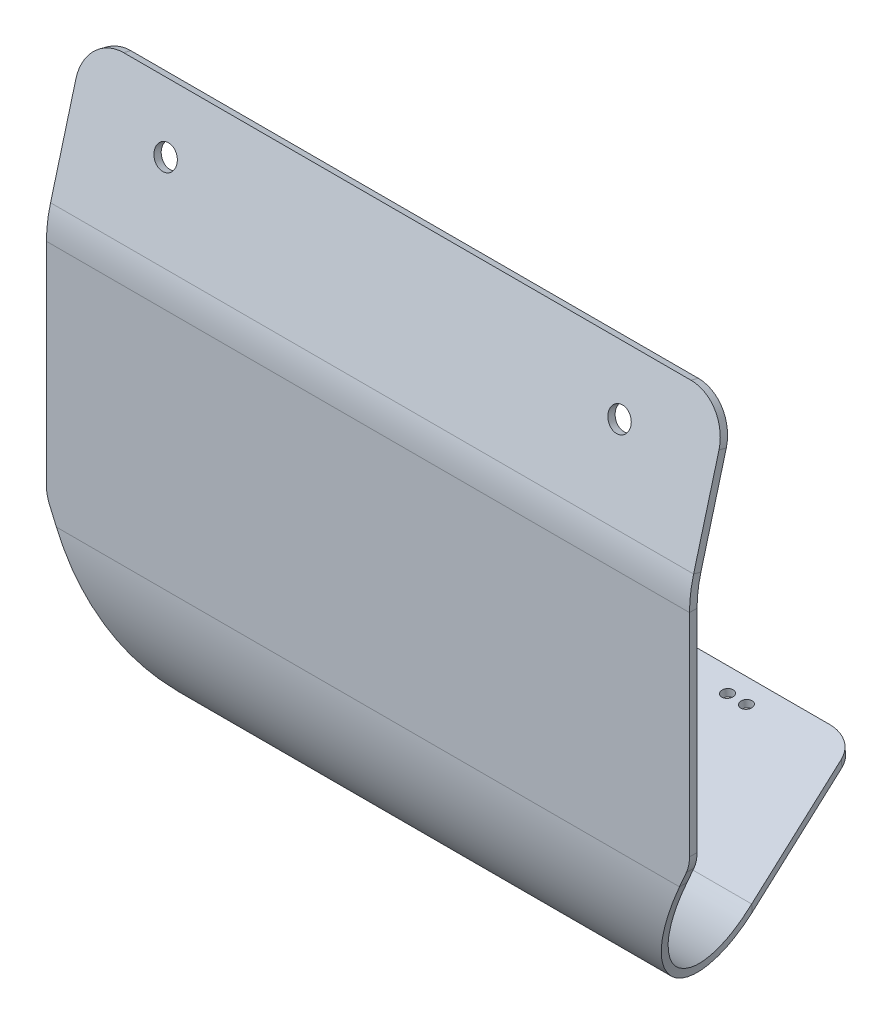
ISO-10303-21;
HEADER;
FILE_DESCRIPTION(('STEP AP214'),'2;1');
FILE_NAME('part.step','',(''),(''),'','','');
FILE_SCHEMA(('AUTOMOTIVE_DESIGN { 1 0 10303 214 1 1 1 1 }'));
ENDSEC;
DATA;
#1=APPLICATION_CONTEXT('core data for automotive mechanical design processes');
#2=APPLICATION_PROTOCOL_DEFINITION('international standard','automotive_design',2000,#1);
#3=PRODUCT_CONTEXT('',#1,'mechanical');
#4=PRODUCT('Part','Part','',(#3));
#5=PRODUCT_RELATED_PRODUCT_CATEGORY('part','',(#4));
#6=PRODUCT_DEFINITION_FORMATION('','',#4);
#7=PRODUCT_DEFINITION_CONTEXT('part definition',#1,'design');
#8=PRODUCT_DEFINITION('design','',#6,#7);
#9=PRODUCT_DEFINITION_SHAPE('','',#8);
#10=(LENGTH_UNIT() NAMED_UNIT(*) SI_UNIT(.MILLI.,.METRE.));
#11=(NAMED_UNIT(*) PLANE_ANGLE_UNIT() SI_UNIT($,.RADIAN.));
#12=(NAMED_UNIT(*) SI_UNIT($,.STERADIAN.) SOLID_ANGLE_UNIT());
#13=UNCERTAINTY_MEASURE_WITH_UNIT(LENGTH_MEASURE(1.E-05),#10,'distance_accuracy_value','');
#14=(GEOMETRIC_REPRESENTATION_CONTEXT(3) GLOBAL_UNCERTAINTY_ASSIGNED_CONTEXT((#13)) GLOBAL_UNIT_ASSIGNED_CONTEXT((#10,
#11,#12)) REPRESENTATION_CONTEXT('',''));
#15=CARTESIAN_POINT('',(0.,0.,0.));
#16=DIRECTION('',(0.,0.,1.));
#17=DIRECTION('',(1.,0.,0.));
#18=AXIS2_PLACEMENT_3D('',#15,#16,#17);
#19=CARTESIAN_POINT('',(-75.,56.6685683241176,-8.39287601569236));
#20=DIRECTION('',(0.,-0.965925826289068,0.258819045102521));
#21=DIRECTION('',(0.,-0.258819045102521,-0.965925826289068));
#22=AXIS2_PLACEMENT_3D('',#19,#20,#21);
#23=PLANE('',#22);
#24=DIRECTION('',(-1.,0.,0.));
#25=VECTOR('',#24,1.);
#26=CARTESIAN_POINT('',(-75.,56.1509302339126,-10.3247276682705));
#27=LINE('',#26,#25);
#28=CARTESIAN_POINT('',(75.,56.1509302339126,-10.3247276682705));
#29=VERTEX_POINT('',#28);
#30=CARTESIAN_POINT('',(-75.,56.1509302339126,-10.3247276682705));
#31=VERTEX_POINT('',#30);
#32=EDGE_CURVE('E49',#29,#31,#27,.T.);
#33=ORIENTED_EDGE('',*,*,#32,.T.);
#34=DIRECTION('',(0.,-0.258819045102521,-0.965925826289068));
#35=VECTOR('',#34,1.);
#36=CARTESIAN_POINT('',(-75.,56.6685683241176,-8.39287601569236));
#37=LINE('',#36,#35);
#38=CARTESIAN_POINT('',(-75.,56.6685683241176,-8.39287601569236));
#39=VERTEX_POINT('',#38);
#40=EDGE_CURVE('E262',#39,#31,#37,.T.);
#41=ORIENTED_EDGE('',*,*,#40,.F.);
#42=DIRECTION('',(-1.,0.,0.));
#43=VECTOR('',#42,1.);
#44=CARTESIAN_POINT('',(-75.,56.6685683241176,-8.39287601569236));
#45=LINE('',#44,#43);
#46=CARTESIAN_POINT('',(75.,56.6685683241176,-8.39287601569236));
#47=VERTEX_POINT('',#46);
#48=EDGE_CURVE('E243',#47,#39,#45,.T.);
#49=ORIENTED_EDGE('',*,*,#48,.F.);
#50=DIRECTION('',(0.,-0.258819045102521,-0.965925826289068));
#51=VECTOR('',#50,1.);
#52=CARTESIAN_POINT('',(75.,56.6685683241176,-8.39287601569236));
#53=LINE('',#52,#51);
#54=EDGE_CURVE('E278',#47,#29,#53,.T.);
#55=ORIENTED_EDGE('',*,*,#54,.T.);
#56=EDGE_LOOP('',(#33,#41,#49,#55));
#57=FACE_BOUND('',#56,.T.);
#58=ADVANCED_FACE('F30',(#57),#23,.F.);
#59=CARTESIAN_POINT('',(75.,47.009310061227,-5.80468556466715));
#60=DIRECTION('',(0.,-0.258819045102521,-0.965925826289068));
#61=DIRECTION('',(-1.,0.,0.));
#62=AXIS2_PLACEMENT_3D('',#59,#60,#61);
#63=CYLINDRICAL_SURFACE('',#62,9.99999999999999);
#64=CARTESIAN_POINT('',(75.,46.4916719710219,-7.73653721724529));
#65=DIRECTION('',(0.,0.258819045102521,0.965925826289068));
#66=DIRECTION('',(1.,0.,0.));
#67=AXIS2_PLACEMENT_3D('',#64,#65,#66);
#68=CIRCLE('',#67,9.99999999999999);
#69=CARTESIAN_POINT('',(85.,46.4916719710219,-7.73653721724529));
#70=VERTEX_POINT('',#69);
#71=EDGE_CURVE('E275',#70,#29,#68,.T.);
#72=ORIENTED_EDGE('',*,*,#71,.T.);
#73=ORIENTED_EDGE('',*,*,#54,.F.);
#74=CARTESIAN_POINT('',(75.,47.009310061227,-5.80468556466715));
#75=DIRECTION('',(0.,0.258819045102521,0.965925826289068));
#76=DIRECTION('',(1.,0.,0.));
#77=AXIS2_PLACEMENT_3D('',#74,#75,#76);
#78=CIRCLE('',#77,9.99999999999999);
#79=CARTESIAN_POINT('',(85.,47.009310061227,-5.80468556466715));
#80=VERTEX_POINT('',#79);
#81=EDGE_CURVE('E245',#80,#47,#78,.T.);
#82=ORIENTED_EDGE('',*,*,#81,.F.);
#83=DIRECTION('',(0.,-0.258819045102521,-0.965925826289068));
#84=VECTOR('',#83,1.);
#85=CARTESIAN_POINT('',(85.,47.009310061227,-5.80468556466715));
#86=LINE('',#85,#84);
#87=EDGE_CURVE('E272',#80,#70,#86,.T.);
#88=ORIENTED_EDGE('',*,*,#87,.T.);
#89=EDGE_LOOP('',(#72,#73,#82,#88));
#90=FACE_BOUND('',#89,.T.);
#91=ADVANCED_FACE('F479',(#90),#63,.T.);
#92=CARTESIAN_POINT('',(-60.,42.1796809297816,-4.51059033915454));
#93=DIRECTION('',(0.,-0.258819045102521,-0.965925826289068));
#94=DIRECTION('',(-1.,0.,0.));
#95=AXIS2_PLACEMENT_3D('',#92,#93,#94);
#96=CYLINDRICAL_SURFACE('',#95,3.);
#97=CARTESIAN_POINT('',(-60.,42.1796809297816,-4.51059033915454));
#98=DIRECTION('',(0.,0.258819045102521,0.965925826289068));
#99=DIRECTION('',(1.,0.,0.));
#100=AXIS2_PLACEMENT_3D('',#97,#98,#99);
#101=CIRCLE('',#100,3.);
#102=CARTESIAN_POINT('',(-57.,42.1796809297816,-4.51059033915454));
#103=VERTEX_POINT('',#102);
#104=EDGE_CURVE('E269',#103,#103,#101,.T.);
#105=ORIENTED_EDGE('',*,*,#104,.T.);
#106=EDGE_LOOP('',(#105));
#107=FACE_BOUND('',#106,.T.);
#108=CARTESIAN_POINT('',(-60.,41.6620428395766,-6.44244199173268));
#109=DIRECTION('',(0.,0.258819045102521,0.965925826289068));
#110=DIRECTION('',(1.,0.,0.));
#111=AXIS2_PLACEMENT_3D('',#108,#109,#110);
#112=CIRCLE('',#111,3.);
#113=CARTESIAN_POINT('',(-57.,41.6620428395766,-6.44244199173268));
#114=VERTEX_POINT('',#113);
#115=EDGE_CURVE('E40',#114,#114,#112,.T.);
#116=ORIENTED_EDGE('',*,*,#115,.F.);
#117=EDGE_LOOP('',(#116));
#118=FACE_BOUND('',#117,.T.);
#119=ADVANCED_FACE('F484',(#107,#118),#96,.F.);
#120=CARTESIAN_POINT('',(60.,42.1796809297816,-4.51059033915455));
#121=DIRECTION('',(0.,-0.258819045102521,-0.965925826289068));
#122=DIRECTION('',(-1.,0.,0.));
#123=AXIS2_PLACEMENT_3D('',#120,#121,#122);
#124=CYLINDRICAL_SURFACE('',#123,3.00000000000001);
#125=CARTESIAN_POINT('',(60.,42.1796809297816,-4.51059033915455));
#126=DIRECTION('',(0.,0.258819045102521,0.965925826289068));
#127=DIRECTION('',(1.,0.,0.));
#128=AXIS2_PLACEMENT_3D('',#125,#126,#127);
#129=CIRCLE('',#128,3.00000000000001);
#130=CARTESIAN_POINT('',(63.,42.1796809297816,-4.51059033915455));
#131=VERTEX_POINT('',#130);
#132=EDGE_CURVE('E266',#131,#131,#129,.T.);
#133=ORIENTED_EDGE('',*,*,#132,.T.);
#134=EDGE_LOOP('',(#133));
#135=FACE_BOUND('',#134,.T.);
#136=CARTESIAN_POINT('',(60.,41.6620428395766,-6.44244199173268));
#137=DIRECTION('',(0.,0.258819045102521,0.965925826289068));
#138=DIRECTION('',(1.,0.,0.));
#139=AXIS2_PLACEMENT_3D('',#136,#137,#138);
#140=CIRCLE('',#139,3.00000000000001);
#141=CARTESIAN_POINT('',(63.,41.6620428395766,-6.44244199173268));
#142=VERTEX_POINT('',#141);
#143=EDGE_CURVE('E11',#142,#142,#140,.T.);
#144=ORIENTED_EDGE('',*,*,#143,.F.);
#145=EDGE_LOOP('',(#144));
#146=FACE_BOUND('',#145,.T.);
#147=ADVANCED_FACE('F492',(#135,#146),#124,.F.);
#148=CARTESIAN_POINT('',(-75.,47.009310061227,-5.80468556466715));
#149=DIRECTION('',(0.,-0.258819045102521,-0.965925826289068));
#150=DIRECTION('',(-1.,0.,0.));
#151=AXIS2_PLACEMENT_3D('',#148,#149,#150);
#152=CYLINDRICAL_SURFACE('',#151,10.);
#153=CARTESIAN_POINT('',(-75.,46.4916719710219,-7.73653721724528));
#154=DIRECTION('',(0.,0.258819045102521,0.965925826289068));
#155=DIRECTION('',(-1.,0.,0.));
#156=AXIS2_PLACEMENT_3D('',#153,#154,#155);
#157=CIRCLE('',#156,10.);
#158=CARTESIAN_POINT('',(-85.,46.4916719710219,-7.73653721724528));
#159=VERTEX_POINT('',#158);
#160=EDGE_CURVE('E264',#31,#159,#157,.T.);
#161=ORIENTED_EDGE('',*,*,#160,.T.);
#162=DIRECTION('',(0.,-0.258819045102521,-0.965925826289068));
#163=VECTOR('',#162,1.);
#164=CARTESIAN_POINT('',(-85.,47.009310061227,-5.80468556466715));
#165=LINE('',#164,#163);
#166=CARTESIAN_POINT('',(-85.,47.009310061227,-5.80468556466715));
#167=VERTEX_POINT('',#166);
#168=EDGE_CURVE('E259',#167,#159,#165,.T.);
#169=ORIENTED_EDGE('',*,*,#168,.F.);
#170=CARTESIAN_POINT('',(-75.,47.009310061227,-5.80468556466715));
#171=DIRECTION('',(0.,0.258819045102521,0.965925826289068));
#172=DIRECTION('',(-1.,0.,0.));
#173=AXIS2_PLACEMENT_3D('',#170,#171,#172);
#174=CIRCLE('',#173,10.);
#175=EDGE_CURVE('E241',#39,#167,#174,.T.);
#176=ORIENTED_EDGE('',*,*,#175,.F.);
#177=ORIENTED_EDGE('',*,*,#40,.T.);
#178=EDGE_LOOP('',(#161,#169,#176,#177));
#179=FACE_BOUND('',#178,.T.);
#180=ADVANCED_FACE('F496',(#179),#152,.T.);
#181=CARTESIAN_POINT('',(-85.,-39.9240143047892,17.4890284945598));
#182=DIRECTION('',(1.,0.,0.));
#183=DIRECTION('',(0.,-0.258819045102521,-0.965925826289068));
#184=AXIS2_PLACEMENT_3D('',#181,#182,#183);
#185=PLANE('',#184);
#186=DIRECTION('',(0.,-0.258819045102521,-0.965925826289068));
#187=VECTOR('',#186,1.);
#188=CARTESIAN_POINT('',(-85.,21.9511565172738,0.909626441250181));
#189=LINE('',#188,#187);
#190=CARTESIAN_POINT('',(-85.,21.9511565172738,0.909626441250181));
#191=VERTEX_POINT('',#190);
#192=CARTESIAN_POINT('',(-85.,21.4335184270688,-1.02222521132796));
#193=VERTEX_POINT('',#192);
#194=EDGE_CURVE('E34',#191,#193,#189,.T.);
#195=ORIENTED_EDGE('',*,*,#194,.F.);
#196=DIRECTION('',(0.,-0.965925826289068,0.258819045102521));
#197=VECTOR('',#196,1.);
#198=CARTESIAN_POINT('',(-85.,-39.9240143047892,17.4890284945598));
#199=LINE('',#198,#197);
#200=EDGE_CURVE('E253',#167,#191,#199,.T.);
#201=ORIENTED_EDGE('',*,*,#200,.F.);
#202=ORIENTED_EDGE('',*,*,#168,.T.);
#203=DIRECTION('',(0.,-0.965925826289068,0.258819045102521));
#204=VECTOR('',#203,1.);
#205=CARTESIAN_POINT('',(-85.,-40.4416523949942,15.5571768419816));
#206=LINE('',#205,#204);
#207=EDGE_CURVE('E256',#159,#193,#206,.T.);
#208=ORIENTED_EDGE('',*,*,#207,.T.);
#209=EDGE_LOOP('',(#195,#201,#202,#208));
#210=FACE_BOUND('',#209,.T.);
#211=ADVANCED_FACE('F500',(#210),#185,.F.);
#212=CARTESIAN_POINT('',(75.,47.009310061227,-5.80468556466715));
#213=DIRECTION('',(0.,0.258819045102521,0.965925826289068));
#214=DIRECTION('',(1.,0.,0.));
#215=AXIS2_PLACEMENT_3D('',#212,#213,#214);
#216=PLANE('',#215);
#217=ORIENTED_EDGE('',*,*,#132,.F.);
#218=EDGE_LOOP('',(#217));
#219=FACE_BOUND('',#218,.T.);
#220=ORIENTED_EDGE('',*,*,#104,.F.);
#221=EDGE_LOOP('',(#220));
#222=FACE_BOUND('',#221,.T.);
#223=ORIENTED_EDGE('',*,*,#200,.T.);
#224=DIRECTION('',(1.,0.,0.));
#225=VECTOR('',#224,1.);
#226=CARTESIAN_POINT('',(75.,21.9511565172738,0.90962644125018));
#227=LINE('',#226,#225);
#228=CARTESIAN_POINT('',(85.,21.9511565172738,0.90962644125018));
#229=VERTEX_POINT('',#228);
#230=EDGE_CURVE('E250',#191,#229,#227,.T.);
#231=ORIENTED_EDGE('',*,*,#230,.T.);
#232=DIRECTION('',(0.,0.965925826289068,-0.258819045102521));
#233=VECTOR('',#232,1.);
#234=CARTESIAN_POINT('',(85.,47.009310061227,-5.80468556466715));
#235=LINE('',#234,#233);
#236=EDGE_CURVE('E248',#229,#80,#235,.T.);
#237=ORIENTED_EDGE('',*,*,#236,.T.);
#238=ORIENTED_EDGE('',*,*,#81,.T.);
#239=ORIENTED_EDGE('',*,*,#48,.T.);
#240=ORIENTED_EDGE('',*,*,#175,.T.);
#241=EDGE_LOOP('',(#223,#231,#237,#238,#239,#240));
#242=FACE_BOUND('',#241,.T.);
#243=ADVANCED_FACE('F504',(#219,#222,#242),#216,.T.);
#244=CARTESIAN_POINT('',(85.,47.009310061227,-5.80468556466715));
#245=DIRECTION('',(-1.,0.,0.));
#246=DIRECTION('',(0.,-0.965925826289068,0.258819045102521));
#247=AXIS2_PLACEMENT_3D('',#244,#245,#246);
#248=PLANE('',#247);
#249=DIRECTION('',(0.,0.258819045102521,0.965925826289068));
#250=VECTOR('',#249,1.);
#251=CARTESIAN_POINT('',(85.,21.9511565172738,0.90962644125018));
#252=LINE('',#251,#250);
#253=CARTESIAN_POINT('',(85.,21.4335184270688,-1.02222521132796));
#254=VERTEX_POINT('',#253);
#255=EDGE_CURVE('E281',#254,#229,#252,.T.);
#256=ORIENTED_EDGE('',*,*,#255,.F.);
#257=DIRECTION('',(0.,0.965925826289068,-0.258819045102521));
#258=VECTOR('',#257,1.);
#259=CARTESIAN_POINT('',(85.,46.4916719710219,-7.73653721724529));
#260=LINE('',#259,#258);
#261=EDGE_CURVE('E239',#254,#70,#260,.T.);
#262=ORIENTED_EDGE('',*,*,#261,.T.);
#263=ORIENTED_EDGE('',*,*,#87,.F.);
#264=ORIENTED_EDGE('',*,*,#236,.F.);
#265=EDGE_LOOP('',(#256,#262,#263,#264));
#266=FACE_BOUND('',#265,.T.);
#267=ADVANCED_FACE('F507',(#266),#248,.F.);
#268=CARTESIAN_POINT('',(75.,46.4916719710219,-7.73653721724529));
#269=DIRECTION('',(0.,0.258819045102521,0.965925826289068));
#270=DIRECTION('',(1.,0.,0.));
#271=AXIS2_PLACEMENT_3D('',#268,#269,#270);
#272=PLANE('',#271);
#273=DIRECTION('',(1.,0.,0.));
#274=VECTOR('',#273,1.);
#275=CARTESIAN_POINT('',(75.,21.4335184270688,-1.02222521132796));
#276=LINE('',#275,#274);
#277=EDGE_CURVE('E282',#193,#254,#276,.T.);
#278=ORIENTED_EDGE('',*,*,#277,.F.);
#279=ORIENTED_EDGE('',*,*,#207,.F.);
#280=ORIENTED_EDGE('',*,*,#160,.F.);
#281=ORIENTED_EDGE('',*,*,#32,.F.);
#282=ORIENTED_EDGE('',*,*,#71,.F.);
#283=ORIENTED_EDGE('',*,*,#261,.F.);
#284=EDGE_LOOP('',(#278,#279,#280,#281,#282,#283));
#285=FACE_BOUND('',#284,.T.);
#286=ORIENTED_EDGE('',*,*,#115,.T.);
#287=EDGE_LOOP('',(#286));
#288=FACE_BOUND('',#287,.T.);
#289=ORIENTED_EDGE('',*,*,#143,.T.);
#290=EDGE_LOOP('',(#289));
#291=FACE_BOUND('',#290,.T.);
#292=ADVANCED_FACE('F32',(#285,#288,#291),#272,.F.);
#293=CARTESIAN_POINT('',(18.4450686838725,-98.9511681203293,-101.674468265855));
#294=DIRECTION('',(0.,-0.0697564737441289,0.997564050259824));
#295=DIRECTION('',(-1.,0.,0.));
#296=AXIS2_PLACEMENT_3D('',#293,#294,#295);
#297=PLANE('',#296);
#298=DIRECTION('',(1.,0.,0.));
#299=VECTOR('',#298,1.);
#300=CARTESIAN_POINT('',(18.4450686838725,-96.9560400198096,-101.534955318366));
#301=LINE('',#300,#299);
#302=CARTESIAN_POINT('',(-18.4450686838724,-96.9560400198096,-101.534955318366));
#303=VERTEX_POINT('',#302);
#304=CARTESIAN_POINT('',(18.4450686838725,-96.9560400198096,-101.534955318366));
#305=VERTEX_POINT('',#304);
#306=EDGE_CURVE('E118',#303,#305,#301,.T.);
#307=ORIENTED_EDGE('',*,*,#306,.T.);
#308=DIRECTION('',(0.,0.997564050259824,0.0697564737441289));
#309=VECTOR('',#308,1.);
#310=CARTESIAN_POINT('',(18.4450686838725,-98.9511681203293,-101.674468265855));
#311=LINE('',#310,#309);
#312=CARTESIAN_POINT('',(18.4450686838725,-98.9511681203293,-101.674468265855));
#313=VERTEX_POINT('',#312);
#314=EDGE_CURVE('E308',#313,#305,#311,.T.);
#315=ORIENTED_EDGE('',*,*,#314,.F.);
#316=DIRECTION('',(1.,0.,0.));
#317=VECTOR('',#316,1.);
#318=CARTESIAN_POINT('',(18.4450686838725,-98.9511681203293,-101.674468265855));
#319=LINE('',#318,#317);
#320=CARTESIAN_POINT('',(-18.4450686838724,-98.9511681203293,-101.674468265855));
#321=VERTEX_POINT('',#320);
#322=EDGE_CURVE('E299',#321,#313,#319,.T.);
#323=ORIENTED_EDGE('',*,*,#322,.F.);
#324=DIRECTION('',(0.,0.997564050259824,0.0697564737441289));
#325=VECTOR('',#324,1.);
#326=CARTESIAN_POINT('',(-18.4450686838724,-98.9511681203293,-101.674468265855));
#327=LINE('',#326,#325);
#328=EDGE_CURVE('E322',#321,#303,#327,.T.);
#329=ORIENTED_EDGE('',*,*,#328,.T.);
#330=EDGE_LOOP('',(#307,#315,#323,#329));
#331=FACE_BOUND('',#330,.T.);
#332=ADVANCED_FACE('F460',(#331),#297,.F.);
#333=CARTESIAN_POINT('',(-18.4450686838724,-99.6487328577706,-91.6988277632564));
#334=DIRECTION('',(0.,0.997564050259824,0.0697564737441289));
#335=DIRECTION('',(-1.,0.,0.));
#336=AXIS2_PLACEMENT_3D('',#333,#334,#335);
#337=CYLINDRICAL_SURFACE('',#336,10.);
#338=CARTESIAN_POINT('',(-18.4450686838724,-97.6536047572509,-91.5593148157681));
#339=DIRECTION('',(0.,-0.997564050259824,-0.0697564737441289));
#340=DIRECTION('',(-1.,0.,0.));
#341=AXIS2_PLACEMENT_3D('',#338,#339,#340);
#342=CIRCLE('',#341,10.);
#343=CARTESIAN_POINT('',(-27.6149129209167,-97.3753301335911,-95.5388273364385));
#344=VERTEX_POINT('',#343);
#345=EDGE_CURVE('E320',#344,#303,#342,.T.);
#346=ORIENTED_EDGE('',*,*,#345,.T.);
#347=ORIENTED_EDGE('',*,*,#328,.F.);
#348=CARTESIAN_POINT('',(-18.4450686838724,-99.6487328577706,-91.6988277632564));
#349=DIRECTION('',(0.,-0.997564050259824,-0.0697564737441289));
#350=DIRECTION('',(-1.,0.,0.));
#351=AXIS2_PLACEMENT_3D('',#348,#349,#350);
#352=CIRCLE('',#351,10.);
#353=CARTESIAN_POINT('',(-27.6149129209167,-99.3704582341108,-95.6783402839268));
#354=VERTEX_POINT('',#353);
#355=EDGE_CURVE('E301',#354,#321,#352,.T.);
#356=ORIENTED_EDGE('',*,*,#355,.F.);
#357=DIRECTION('',(0.,0.997564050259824,0.0697564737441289));
#358=VECTOR('',#357,1.);
#359=CARTESIAN_POINT('',(-27.6149129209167,-99.3704582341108,-95.6783402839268));
#360=LINE('',#359,#358);
#361=EDGE_CURVE('E318',#354,#344,#360,.T.);
#362=ORIENTED_EDGE('',*,*,#361,.T.);
#363=EDGE_LOOP('',(#346,#347,#356,#362));
#364=FACE_BOUND('',#363,.T.);
#365=ADVANCED_FACE('F463',(#364),#337,.T.);
#366=CARTESIAN_POINT('',(2.50000000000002,-99.3697069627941,-95.6890839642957));
#367=DIRECTION('',(0.,0.997564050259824,0.0697564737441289));
#368=DIRECTION('',(-1.,0.,0.));
#369=AXIS2_PLACEMENT_3D('',#366,#367,#368);
#370=CYLINDRICAL_SURFACE('',#369,1.5);
#371=CARTESIAN_POINT('',(2.50000000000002,-99.3697069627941,-95.6890839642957));
#372=DIRECTION('',(0.,-0.997564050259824,-0.0697564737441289));
#373=DIRECTION('',(1.,0.,0.));
#374=AXIS2_PLACEMENT_3D('',#371,#372,#373);
#375=CIRCLE('',#374,1.5);
#376=CARTESIAN_POINT('',(4.00000000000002,-99.3697069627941,-95.6890839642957));
#377=VERTEX_POINT('',#376);
#378=EDGE_CURVE('E315',#377,#377,#375,.T.);
#379=ORIENTED_EDGE('',*,*,#378,.T.);
#380=EDGE_LOOP('',(#379));
#381=FACE_BOUND('',#380,.T.);
#382=CARTESIAN_POINT('',(2.50000000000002,-97.3745788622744,-95.5495710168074));
#383=DIRECTION('',(0.,-0.997564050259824,-0.0697564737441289));
#384=DIRECTION('',(1.,0.,0.));
#385=AXIS2_PLACEMENT_3D('',#382,#383,#384);
#386=CIRCLE('',#385,1.5);
#387=CARTESIAN_POINT('',(4.00000000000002,-97.3745788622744,-95.5495710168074));
#388=VERTEX_POINT('',#387);
#389=EDGE_CURVE('E285',#388,#388,#386,.T.);
#390=ORIENTED_EDGE('',*,*,#389,.F.);
#391=EDGE_LOOP('',(#390));
#392=FACE_BOUND('',#391,.T.);
#393=ADVANCED_FACE('F466',(#381,#392),#370,.F.);
#394=CARTESIAN_POINT('',(-2.49999999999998,-99.3697069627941,-95.6890839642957));
#395=DIRECTION('',(0.,0.997564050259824,0.0697564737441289));
#396=DIRECTION('',(-1.,0.,0.));
#397=AXIS2_PLACEMENT_3D('',#394,#395,#396);
#398=CYLINDRICAL_SURFACE('',#397,1.5);
#399=CARTESIAN_POINT('',(-2.49999999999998,-99.3697069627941,-95.6890839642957));
#400=DIRECTION('',(0.,-0.997564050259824,-0.0697564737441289));
#401=DIRECTION('',(1.,0.,0.));
#402=AXIS2_PLACEMENT_3D('',#399,#400,#401);
#403=CIRCLE('',#402,1.5);
#404=CARTESIAN_POINT('',(-0.999999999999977,-99.3697069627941,-95.6890839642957));
#405=VERTEX_POINT('',#404);
#406=EDGE_CURVE('E312',#405,#405,#403,.T.);
#407=ORIENTED_EDGE('',*,*,#406,.T.);
#408=EDGE_LOOP('',(#407));
#409=FACE_BOUND('',#408,.T.);
#410=CARTESIAN_POINT('',(-2.49999999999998,-97.3745788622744,-95.5495710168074));
#411=DIRECTION('',(0.,-0.997564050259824,-0.0697564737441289));
#412=DIRECTION('',(1.,0.,0.));
#413=AXIS2_PLACEMENT_3D('',#410,#411,#412);
#414=CIRCLE('',#413,1.5);
#415=CARTESIAN_POINT('',(-0.999999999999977,-97.3745788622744,-95.5495710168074));
#416=VERTEX_POINT('',#415);
#417=EDGE_CURVE('E283',#416,#416,#414,.T.);
#418=ORIENTED_EDGE('',*,*,#417,.F.);
#419=EDGE_LOOP('',(#418));
#420=FACE_BOUND('',#419,.T.);
#421=ADVANCED_FACE('F469',(#409,#420),#398,.F.);
#422=CARTESIAN_POINT('',(18.4450686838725,-99.6487328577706,-91.6988277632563));
#423=DIRECTION('',(0.,0.997564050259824,0.0697564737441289));
#424=DIRECTION('',(-1.,0.,0.));
#425=AXIS2_PLACEMENT_3D('',#422,#423,#424);
#426=CYLINDRICAL_SURFACE('',#425,10.);
#427=CARTESIAN_POINT('',(18.4450686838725,-97.6536047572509,-91.5593148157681));
#428=DIRECTION('',(0.,-0.997564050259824,-0.0697564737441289));
#429=DIRECTION('',(-1.,0.,0.));
#430=AXIS2_PLACEMENT_3D('',#427,#428,#429);
#431=CIRCLE('',#430,10.);
#432=CARTESIAN_POINT('',(27.6149129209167,-97.3753301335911,-95.5388273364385));
#433=VERTEX_POINT('',#432);
#434=EDGE_CURVE('E310',#305,#433,#431,.T.);
#435=ORIENTED_EDGE('',*,*,#434,.T.);
#436=DIRECTION('',(0.,0.997564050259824,0.0697564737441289));
#437=VECTOR('',#436,1.);
#438=CARTESIAN_POINT('',(27.6149129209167,-99.3704582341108,-95.6783402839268));
#439=LINE('',#438,#437);
#440=CARTESIAN_POINT('',(27.6149129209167,-99.3704582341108,-95.6783402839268));
#441=VERTEX_POINT('',#440);
#442=EDGE_CURVE('E304',#441,#433,#439,.T.);
#443=ORIENTED_EDGE('',*,*,#442,.F.);
#444=CARTESIAN_POINT('',(18.4450686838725,-99.6487328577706,-91.6988277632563));
#445=DIRECTION('',(0.,-0.997564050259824,-0.0697564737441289));
#446=DIRECTION('',(-1.,0.,0.));
#447=AXIS2_PLACEMENT_3D('',#444,#445,#446);
#448=CIRCLE('',#447,10.);
#449=EDGE_CURVE('E297',#313,#441,#448,.T.);
#450=ORIENTED_EDGE('',*,*,#449,.F.);
#451=ORIENTED_EDGE('',*,*,#314,.T.);
#452=EDGE_LOOP('',(#435,#443,#450,#451));
#453=FACE_BOUND('',#452,.T.);
#454=ADVANCED_FACE('F362',(#453),#426,.T.);
#455=CARTESIAN_POINT('',(84.1698442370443,-108.438799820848,34.0049862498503));
#456=DIRECTION('',(-0.916984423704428,-0.0278274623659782,0.397951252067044));
#457=DIRECTION('',(-0.398923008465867,0.0639655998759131,-0.91475069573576));
#458=AXIS2_PLACEMENT_3D('',#455,#456,#457);
#459=PLANE('',#458);
#460=CARTESIAN_POINT('',(45.9533661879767,-102.310950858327,-53.6273366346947));
#461=CARTESIAN_POINT('',(45.9533661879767,-100.315822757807,-53.4878236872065));
#462=B_SPLINE_CURVE_WITH_KNOTS('',1,(#460,#461),.UNSPECIFIED.,.F.,.F.,(2,2),(0.,1.),.UNSPECIFIED.);
#463=CARTESIAN_POINT('',(45.9533661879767,-102.310950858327,-53.6273366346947));
#464=VERTEX_POINT('',#463);
#465=CARTESIAN_POINT('',(45.9533661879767,-100.315822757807,-53.4878236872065));
#466=VERTEX_POINT('',#465);
#467=EDGE_CURVE('E344',#464,#466,#462,.T.);
#468=ORIENTED_EDGE('',*,*,#467,.F.);
#469=DIRECTION('',(0.398923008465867,-0.0639655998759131,0.91475069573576));
#470=VECTOR('',#469,1.);
#471=CARTESIAN_POINT('',(84.1698442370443,-108.438799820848,34.0049862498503));
#472=LINE('',#471,#470);
#473=EDGE_CURVE('E329',#441,#464,#472,.T.);
#474=ORIENTED_EDGE('',*,*,#473,.F.);
#475=ORIENTED_EDGE('',*,*,#442,.T.);
#476=DIRECTION('',(0.398923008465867,-0.0639655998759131,0.91475069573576));
#477=VECTOR('',#476,1.);
#478=CARTESIAN_POINT('',(84.1698442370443,-106.443671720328,34.1444991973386));
#479=LINE('',#478,#477);
#480=EDGE_CURVE('E307',#433,#466,#479,.T.);
#481=ORIENTED_EDGE('',*,*,#480,.T.);
#482=EDGE_LOOP('',(#468,#474,#475,#481));
#483=FACE_BOUND('',#482,.T.);
#484=ADVANCED_FACE('F351',(#483),#459,.F.);
#485=CARTESIAN_POINT('',(75.,-114.995157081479,127.765263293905));
#486=DIRECTION('',(0.,-0.997564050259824,-0.0697564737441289));
#487=DIRECTION('',(1.,0.,0.));
#488=AXIS2_PLACEMENT_3D('',#485,#486,#487);
#489=PLANE('',#488);
#490=ORIENTED_EDGE('',*,*,#406,.F.);
#491=EDGE_LOOP('',(#490));
#492=FACE_BOUND('',#491,.T.);
#493=ORIENTED_EDGE('',*,*,#378,.F.);
#494=EDGE_LOOP('',(#493));
#495=FACE_BOUND('',#494,.T.);
#496=ORIENTED_EDGE('',*,*,#473,.T.);
#497=DIRECTION('',(-1.,0.,0.));
#498=VECTOR('',#497,1.);
#499=CARTESIAN_POINT('',(75.,-102.310950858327,-53.6273366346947));
#500=LINE('',#499,#498);
#501=CARTESIAN_POINT('',(-45.9533661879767,-102.310950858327,-53.6273366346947));
#502=VERTEX_POINT('',#501);
#503=EDGE_CURVE('E326',#464,#502,#500,.T.);
#504=ORIENTED_EDGE('',*,*,#503,.T.);
#505=DIRECTION('',(0.398923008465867,0.0639655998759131,-0.91475069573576));
#506=VECTOR('',#505,1.);
#507=CARTESIAN_POINT('',(-27.6149129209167,-99.3704582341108,-95.6783402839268));
#508=LINE('',#507,#506);
#509=EDGE_CURVE('E303',#502,#354,#508,.T.);
#510=ORIENTED_EDGE('',*,*,#509,.T.);
#511=ORIENTED_EDGE('',*,*,#355,.T.);
#512=ORIENTED_EDGE('',*,*,#322,.T.);
#513=ORIENTED_EDGE('',*,*,#449,.T.);
#514=EDGE_LOOP('',(#496,#504,#510,#511,#512,#513));
#515=FACE_BOUND('',#514,.T.);
#516=ADVANCED_FACE('F361',(#492,#495,#515),#489,.T.);
#517=CARTESIAN_POINT('',(-27.6149129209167,-99.3704582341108,-95.6783402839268));
#518=DIRECTION('',(0.916984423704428,-0.0278274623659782,0.397951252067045));
#519=DIRECTION('',(-0.398923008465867,-0.0639655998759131,0.91475069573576));
#520=AXIS2_PLACEMENT_3D('',#517,#518,#519);
#521=PLANE('',#520);
#522=CARTESIAN_POINT('',(-45.9533661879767,-100.315822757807,-53.4878236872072));
#523=CARTESIAN_POINT('',(-45.9533661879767,-102.310950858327,-53.6273366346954));
#524=B_SPLINE_CURVE_WITH_KNOTS('',1,(#522,#523),.UNSPECIFIED.,.F.,.F.,(2,2),(0.,1.),.UNSPECIFIED.);
#525=CARTESIAN_POINT('',(-45.9533661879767,-100.315822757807,-53.4878236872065));
#526=VERTEX_POINT('',#525);
#527=EDGE_CURVE('E325',#526,#502,#524,.T.);
#528=ORIENTED_EDGE('',*,*,#527,.F.);
#529=DIRECTION('',(0.398923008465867,0.0639655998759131,-0.91475069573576));
#530=VECTOR('',#529,1.);
#531=CARTESIAN_POINT('',(-27.6149129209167,-97.3753301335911,-95.5388273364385));
#532=LINE('',#531,#530);
#533=EDGE_CURVE('E90',#526,#344,#532,.T.);
#534=ORIENTED_EDGE('',*,*,#533,.T.);
#535=ORIENTED_EDGE('',*,*,#361,.F.);
#536=ORIENTED_EDGE('',*,*,#509,.F.);
#537=EDGE_LOOP('',(#528,#534,#535,#536));
#538=FACE_BOUND('',#537,.T.);
#539=ADVANCED_FACE('F366',(#538),#521,.F.);
#540=CARTESIAN_POINT('',(75.,-113.000028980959,127.904776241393));
#541=DIRECTION('',(0.,-0.997564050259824,-0.0697564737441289));
#542=DIRECTION('',(1.,0.,0.));
#543=AXIS2_PLACEMENT_3D('',#540,#541,#542);
#544=PLANE('',#543);
#545=DIRECTION('',(-1.,0.,0.));
#546=VECTOR('',#545,1.);
#547=CARTESIAN_POINT('',(75.,-100.315822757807,-53.4878236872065));
#548=LINE('',#547,#546);
#549=EDGE_CURVE('E349',#466,#526,#548,.T.);
#550=ORIENTED_EDGE('',*,*,#549,.F.);
#551=ORIENTED_EDGE('',*,*,#480,.F.);
#552=ORIENTED_EDGE('',*,*,#434,.F.);
#553=ORIENTED_EDGE('',*,*,#306,.F.);
#554=ORIENTED_EDGE('',*,*,#345,.F.);
#555=ORIENTED_EDGE('',*,*,#533,.F.);
#556=EDGE_LOOP('',(#550,#551,#552,#553,#554,#555));
#557=FACE_BOUND('',#556,.T.);
#558=ORIENTED_EDGE('',*,*,#389,.T.);
#559=EDGE_LOOP('',(#558));
#560=FACE_BOUND('',#559,.T.);
#561=ORIENTED_EDGE('',*,*,#417,.T.);
#562=EDGE_LOOP('',(#561));
#563=FACE_BOUND('',#562,.T.);
#564=ADVANCED_FACE('F371',(#557,#560,#563),#544,.F.);
#565=CARTESIAN_POINT('',(75.,47.72683758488,0.));
#566=DIRECTION('',(0.,0.,1.));
#567=DIRECTION('',(1.,0.,0.));
#568=AXIS2_PLACEMENT_3D('',#565,#566,#567);
#569=PLANE('',#568);
#570=DIRECTION('',(0.,-1.,0.));
#571=VECTOR('',#570,1.);
#572=CARTESIAN_POINT('',(-85.,-42.27316241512,0.));
#573=LINE('',#572,#571);
#574=CARTESIAN_POINT('',(-85.,13.6689470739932,0.));
#575=VERTEX_POINT('',#574);
#576=CARTESIAN_POINT('',(-85.,-42.27316241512,0.));
#577=VERTEX_POINT('',#576);
#578=EDGE_CURVE('E221',#575,#577,#573,.T.);
#579=ORIENTED_EDGE('',*,*,#578,.F.);
#580=DIRECTION('',(1.,0.,0.));
#581=VECTOR('',#580,1.);
#582=CARTESIAN_POINT('',(75.,13.6689470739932,0.));
#583=LINE('',#582,#581);
#584=CARTESIAN_POINT('',(85.,13.6689470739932,0.));
#585=VERTEX_POINT('',#584);
#586=EDGE_CURVE('E198',#575,#585,#583,.T.);
#587=ORIENTED_EDGE('',*,*,#586,.T.);
#588=DIRECTION('',(0.,1.,0.));
#589=VECTOR('',#588,1.);
#590=CARTESIAN_POINT('',(85.,47.72683758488,0.));
#591=LINE('',#590,#589);
#592=CARTESIAN_POINT('',(85.,-42.27316241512,0.));
#593=VERTEX_POINT('',#592);
#594=EDGE_CURVE('E379',#593,#585,#591,.T.);
#595=ORIENTED_EDGE('',*,*,#594,.F.);
#596=CARTESIAN_POINT('',(75.,-42.27316241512,0.));
#597=DIRECTION('',(0.,0.,1.));
#598=DIRECTION('',(-1.,0.,0.));
#599=AXIS2_PLACEMENT_3D('',#596,#597,#598);
#600=CIRCLE('',#599,10.);
#601=CARTESIAN_POINT('',(84.1698442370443,-46.2623924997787,0.));
#602=VERTEX_POINT('',#601);
#603=EDGE_CURVE('E385',#602,#593,#600,.T.);
#604=ORIENTED_EDGE('',*,*,#603,.F.);
#605=DIRECTION('',(0.398923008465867,0.916984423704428,0.));
#606=VECTOR('',#605,1.);
#607=CARTESIAN_POINT('',(84.1698442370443,-46.2623924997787,0.));
#608=LINE('',#607,#606);
#609=CARTESIAN_POINT('',(82.3534617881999,-50.4376202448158,0.));
#610=VERTEX_POINT('',#609);
#611=EDGE_CURVE('E426',#610,#602,#608,.T.);
#612=ORIENTED_EDGE('',*,*,#611,.F.);
#613=DIRECTION('',(-1.,0.,0.));
#614=VECTOR('',#613,1.);
#615=CARTESIAN_POINT('',(75.,-50.4376202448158,0.));
#616=LINE('',#615,#614);
#617=CARTESIAN_POINT('',(-82.3534617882,-50.4376202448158,0.));
#618=VERTEX_POINT('',#617);
#619=EDGE_CURVE('E418',#610,#618,#616,.T.);
#620=ORIENTED_EDGE('',*,*,#619,.T.);
#621=DIRECTION('',(0.398923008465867,-0.916984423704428,0.));
#622=VECTOR('',#621,1.);
#623=CARTESIAN_POINT('',(-27.6149129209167,-176.262392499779,0.));
#624=LINE('',#623,#622);
#625=CARTESIAN_POINT('',(-84.1698442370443,-46.2623924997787,0.));
#626=VERTEX_POINT('',#625);
#627=EDGE_CURVE('E231',#626,#618,#624,.T.);
#628=ORIENTED_EDGE('',*,*,#627,.F.);
#629=CARTESIAN_POINT('',(-75.,-42.27316241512,0.));
#630=DIRECTION('',(0.,0.,1.));
#631=DIRECTION('',(-1.,0.,0.));
#632=AXIS2_PLACEMENT_3D('',#629,#630,#631);
#633=CIRCLE('',#632,10.);
#634=EDGE_CURVE('E229',#577,#626,#633,.T.);
#635=ORIENTED_EDGE('',*,*,#634,.F.);
#636=EDGE_LOOP('',(#579,#587,#595,#604,#612,#620,#628,#635));
#637=FACE_BOUND('',#636,.T.);
#638=ADVANCED_FACE('F227',(#637),#569,.F.);
#639=CARTESIAN_POINT('',(-85.,-42.27316241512,2.));
#640=DIRECTION('',(1.,0.,0.));
#641=DIRECTION('',(0.,0.,-1.));
#642=AXIS2_PLACEMENT_3D('',#639,#640,#641);
#643=PLANE('',#642);
#644=DIRECTION('',(0.,-1.,0.));
#645=VECTOR('',#644,1.);
#646=CARTESIAN_POINT('',(-85.,-42.27316241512,2.));
#647=LINE('',#646,#645);
#648=CARTESIAN_POINT('',(-85.,13.6689470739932,2.));
#649=VERTEX_POINT('',#648);
#650=CARTESIAN_POINT('',(-85.,-42.27316241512,2.));
#651=VERTEX_POINT('',#650);
#652=EDGE_CURVE('E223',#649,#651,#647,.T.);
#653=ORIENTED_EDGE('',*,*,#652,.F.);
#654=DIRECTION('',(0.,0.,-1.));
#655=VECTOR('',#654,1.);
#656=CARTESIAN_POINT('',(-85.,13.6689470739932,2.));
#657=LINE('',#656,#655);
#658=EDGE_CURVE('E208',#649,#575,#657,.T.);
#659=ORIENTED_EDGE('',*,*,#658,.T.);
#660=ORIENTED_EDGE('',*,*,#578,.T.);
#661=DIRECTION('',(0.,0.,-1.));
#662=VECTOR('',#661,1.);
#663=CARTESIAN_POINT('',(-85.,-42.27316241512,2.));
#664=LINE('',#663,#662);
#665=EDGE_CURVE('E411',#651,#577,#664,.T.);
#666=ORIENTED_EDGE('',*,*,#665,.F.);
#667=EDGE_LOOP('',(#653,#659,#660,#666));
#668=FACE_BOUND('',#667,.T.);
#669=ADVANCED_FACE('F219',(#668),#643,.F.);
#670=CARTESIAN_POINT('',(85.,47.72683758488,2.));
#671=DIRECTION('',(-1.,0.,0.));
#672=DIRECTION('',(0.,-1.,0.));
#673=AXIS2_PLACEMENT_3D('',#670,#671,#672);
#674=PLANE('',#673);
#675=ORIENTED_EDGE('',*,*,#594,.T.);
#676=DIRECTION('',(0.,0.,1.));
#677=VECTOR('',#676,1.);
#678=CARTESIAN_POINT('',(85.,13.6689470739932,2.));
#679=LINE('',#678,#677);
#680=CARTESIAN_POINT('',(85.,13.6689470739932,2.));
#681=VERTEX_POINT('',#680);
#682=EDGE_CURVE('E224',#585,#681,#679,.T.);
#683=ORIENTED_EDGE('',*,*,#682,.T.);
#684=DIRECTION('',(0.,1.,0.));
#685=VECTOR('',#684,1.);
#686=CARTESIAN_POINT('',(85.,47.72683758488,2.));
#687=LINE('',#686,#685);
#688=CARTESIAN_POINT('',(85.,-42.27316241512,2.));
#689=VERTEX_POINT('',#688);
#690=EDGE_CURVE('E386',#689,#681,#687,.T.);
#691=ORIENTED_EDGE('',*,*,#690,.F.);
#692=DIRECTION('',(0.,0.,-1.));
#693=VECTOR('',#692,1.);
#694=CARTESIAN_POINT('',(85.,-42.27316241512,2.));
#695=LINE('',#694,#693);
#696=EDGE_CURVE('E388',#689,#593,#695,.T.);
#697=ORIENTED_EDGE('',*,*,#696,.T.);
#698=EDGE_LOOP('',(#675,#683,#691,#697));
#699=FACE_BOUND('',#698,.T.);
#700=ADVANCED_FACE('F458',(#699),#674,.F.);
#701=CARTESIAN_POINT('',(-27.6149129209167,-176.262392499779,2.));
#702=DIRECTION('',(0.916984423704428,0.398923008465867,0.));
#703=DIRECTION('',(-0.398923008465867,0.916984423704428,0.));
#704=AXIS2_PLACEMENT_3D('',#701,#702,#703);
#705=PLANE('',#704);
#706=ORIENTED_EDGE('',*,*,#627,.T.);
#707=CARTESIAN_POINT('',(-82.3534617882,-50.4376202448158,2.));
#708=CARTESIAN_POINT('',(-82.3534617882,-50.4376202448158,0.));
#709=B_SPLINE_CURVE_WITH_KNOTS('',1,(#707,#708),.UNSPECIFIED.,.F.,.F.,(2,2),(0.,1.),.UNSPECIFIED.);
#710=CARTESIAN_POINT('',(-82.3534617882,-50.4376202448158,2.));
#711=VERTEX_POINT('',#710);
#712=EDGE_CURVE('E421',#618,#711,#709,.F.);
#713=ORIENTED_EDGE('',*,*,#712,.T.);
#714=DIRECTION('',(0.398923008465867,-0.916984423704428,0.));
#715=VECTOR('',#714,1.);
#716=CARTESIAN_POINT('',(-27.6149129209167,-176.262392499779,2.));
#717=LINE('',#716,#715);
#718=CARTESIAN_POINT('',(-84.1698442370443,-46.2623924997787,2.));
#719=VERTEX_POINT('',#718);
#720=EDGE_CURVE('E400',#719,#711,#717,.T.);
#721=ORIENTED_EDGE('',*,*,#720,.F.);
#722=DIRECTION('',(0.,0.,-1.));
#723=VECTOR('',#722,1.);
#724=CARTESIAN_POINT('',(-84.1698442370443,-46.2623924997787,2.));
#725=LINE('',#724,#723);
#726=EDGE_CURVE('E408',#719,#626,#725,.T.);
#727=ORIENTED_EDGE('',*,*,#726,.T.);
#728=EDGE_LOOP('',(#706,#713,#721,#727));
#729=FACE_BOUND('',#728,.T.);
#730=ADVANCED_FACE('F452',(#729),#705,.F.);
#731=CARTESIAN_POINT('',(84.1698442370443,-46.2623924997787,2.));
#732=DIRECTION('',(-0.916984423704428,0.398923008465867,0.));
#733=DIRECTION('',(-0.398923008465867,-0.916984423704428,0.));
#734=AXIS2_PLACEMENT_3D('',#731,#732,#733);
#735=PLANE('',#734);
#736=DIRECTION('',(0.398923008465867,0.916984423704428,0.));
#737=VECTOR('',#736,1.);
#738=CARTESIAN_POINT('',(84.1698442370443,-46.2623924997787,2.));
#739=LINE('',#738,#737);
#740=CARTESIAN_POINT('',(82.3534617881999,-50.4376202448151,2.));
#741=VERTEX_POINT('',#740);
#742=CARTESIAN_POINT('',(84.1698442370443,-46.2623924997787,2.));
#743=VERTEX_POINT('',#742);
#744=EDGE_CURVE('E396',#741,#743,#739,.T.);
#745=ORIENTED_EDGE('',*,*,#744,.F.);
#746=CARTESIAN_POINT('',(82.3534617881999,-50.4376202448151,0.));
#747=CARTESIAN_POINT('',(82.3534617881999,-50.4376202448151,2.));
#748=B_SPLINE_CURVE_WITH_KNOTS('',1,(#746,#747),.UNSPECIFIED.,.F.,.F.,(2,2),(0.,1.),.UNSPECIFIED.);
#749=EDGE_CURVE('E413',#741,#610,#748,.F.);
#750=ORIENTED_EDGE('',*,*,#749,.T.);
#751=ORIENTED_EDGE('',*,*,#611,.T.);
#752=DIRECTION('',(0.,0.,-1.));
#753=VECTOR('',#752,1.);
#754=CARTESIAN_POINT('',(84.1698442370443,-46.2623924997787,2.));
#755=LINE('',#754,#753);
#756=EDGE_CURVE('E394',#743,#602,#755,.T.);
#757=ORIENTED_EDGE('',*,*,#756,.F.);
#758=EDGE_LOOP('',(#745,#750,#751,#757));
#759=FACE_BOUND('',#758,.T.);
#760=ADVANCED_FACE('F442',(#759),#735,.F.);
#761=CARTESIAN_POINT('',(75.,47.72683758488,2.));
#762=DIRECTION('',(0.,0.,1.));
#763=DIRECTION('',(1.,0.,0.));
#764=AXIS2_PLACEMENT_3D('',#761,#762,#763);
#765=PLANE('',#764);
#766=DIRECTION('',(1.,0.,0.));
#767=VECTOR('',#766,1.);
#768=CARTESIAN_POINT('',(75.,13.6689470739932,2.));
#769=LINE('',#768,#767);
#770=EDGE_CURVE('E207',#649,#681,#769,.T.);
#771=ORIENTED_EDGE('',*,*,#770,.F.);
#772=ORIENTED_EDGE('',*,*,#652,.T.);
#773=CARTESIAN_POINT('',(-75.,-42.27316241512,2.));
#774=DIRECTION('',(0.,0.,1.));
#775=DIRECTION('',(-1.,0.,0.));
#776=AXIS2_PLACEMENT_3D('',#773,#774,#775);
#777=CIRCLE('',#776,10.);
#778=EDGE_CURVE('E403',#651,#719,#777,.T.);
#779=ORIENTED_EDGE('',*,*,#778,.T.);
#780=ORIENTED_EDGE('',*,*,#720,.T.);
#781=DIRECTION('',(-1.,0.,0.));
#782=VECTOR('',#781,1.);
#783=CARTESIAN_POINT('',(75.,-50.4376202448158,2.));
#784=LINE('',#783,#782);
#785=EDGE_CURVE('E415',#741,#711,#784,.T.);
#786=ORIENTED_EDGE('',*,*,#785,.F.);
#787=ORIENTED_EDGE('',*,*,#744,.T.);
#788=CARTESIAN_POINT('',(75.,-42.27316241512,2.));
#789=DIRECTION('',(0.,0.,1.));
#790=DIRECTION('',(-1.,0.,0.));
#791=AXIS2_PLACEMENT_3D('',#788,#789,#790);
#792=CIRCLE('',#791,10.);
#793=EDGE_CURVE('E389',#743,#689,#792,.T.);
#794=ORIENTED_EDGE('',*,*,#793,.T.);
#795=ORIENTED_EDGE('',*,*,#690,.T.);
#796=EDGE_LOOP('',(#771,#772,#779,#780,#786,#787,#794,#795));
#797=FACE_BOUND('',#796,.T.);
#798=ADVANCED_FACE('F451',(#797),#765,.T.);
#799=CARTESIAN_POINT('',(-75.,-42.27316241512,2.));
#800=DIRECTION('',(0.,0.,-1.));
#801=DIRECTION('',(-1.,0.,0.));
#802=AXIS2_PLACEMENT_3D('',#799,#800,#801);
#803=CYLINDRICAL_SURFACE('',#802,10.);
#804=ORIENTED_EDGE('',*,*,#634,.T.);
#805=ORIENTED_EDGE('',*,*,#726,.F.);
#806=ORIENTED_EDGE('',*,*,#778,.F.);
#807=ORIENTED_EDGE('',*,*,#665,.T.);
#808=EDGE_LOOP('',(#804,#805,#806,#807));
#809=FACE_BOUND('',#808,.T.);
#810=ADVANCED_FACE('F453',(#809),#803,.T.);
#811=CARTESIAN_POINT('',(75.,-42.27316241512,2.));
#812=DIRECTION('',(0.,0.,-1.));
#813=DIRECTION('',(-1.,0.,0.));
#814=AXIS2_PLACEMENT_3D('',#811,#812,#813);
#815=CYLINDRICAL_SURFACE('',#814,10.);
#816=ORIENTED_EDGE('',*,*,#603,.T.);
#817=ORIENTED_EDGE('',*,*,#696,.F.);
#818=ORIENTED_EDGE('',*,*,#793,.F.);
#819=ORIENTED_EDGE('',*,*,#756,.T.);
#820=EDGE_LOOP('',(#816,#817,#818,#819));
#821=FACE_BOUND('',#820,.T.);
#822=ADVANCED_FACE('F597',(#821),#815,.T.);
#823=CARTESIAN_POINT('',(45.9533661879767,-102.310950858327,-53.6273366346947));
#824=CARTESIAN_POINT('',(47.4700541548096,-102.558913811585,-50.0813011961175));
#825=CARTESIAN_POINT('',(48.9867074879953,-102.441995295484,-46.5099369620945));
#826=CARTESIAN_POINT('',(52.0200487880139,-101.483298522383,-39.4655662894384));
#827=CARTESIAN_POINT('',(53.5367194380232,-100.641545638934,-35.9928075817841));
#828=CARTESIAN_POINT('',(56.5700607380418,-98.2684099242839,-29.2912790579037));
#829=CARTESIAN_POINT('',(58.0867313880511,-96.7370969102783,-26.0627063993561));
#830=CARTESIAN_POINT('',(61.1200726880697,-93.0489781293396,-19.9848747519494));
#831=CARTESIAN_POINT('',(62.636743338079,-90.8922808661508,-17.1357945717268));
#832=CARTESIAN_POINT('',(65.6700846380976,-86.0437445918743,-11.936375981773));
#833=CARTESIAN_POINT('',(67.1867552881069,-83.35204822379,-9.5861905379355));
#834=CARTESIAN_POINT('',(70.2200965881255,-77.5462920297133,-5.48308772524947));
#835=CARTESIAN_POINT('',(71.7367672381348,-74.43240300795,-3.73029106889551));
#836=CARTESIAN_POINT('',(74.7701085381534,-67.9127406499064,-0.89546119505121));
#837=CARTESIAN_POINT('',(76.2867791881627,-64.5071591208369,0.186488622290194));
#838=CARTESIAN_POINT('',(79.3201204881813,-57.546823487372,1.63424051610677));
#839=CARTESIAN_POINT('',(80.8367738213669,-53.9923147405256,2.00000000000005));
#840=CARTESIAN_POINT('',(82.3534617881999,-50.4376202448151,2.));
#841=CARTESIAN_POINT('',(45.9533661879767,-100.315822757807,-53.4878236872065));
#842=CARTESIAN_POINT('',(47.4700539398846,-100.554248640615,-50.0781747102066));
#843=CARTESIAN_POINT('',(48.9867074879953,-100.441827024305,-46.6441701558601));
#844=CARTESIAN_POINT('',(52.0200487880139,-99.5200032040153,-39.8707368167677));
#845=CARTESIAN_POINT('',(53.5367194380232,-98.7106254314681,-36.5315457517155));
#846=CARTESIAN_POINT('',(56.5700607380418,-96.4287641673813,-30.0877683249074));
#847=CARTESIAN_POINT('',(58.0867313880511,-94.9563478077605,-26.9833715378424));
#848=CARTESIAN_POINT('',(61.1200726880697,-91.4100797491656,-21.1393026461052));
#849=CARTESIAN_POINT('',(62.636743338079,-89.3363323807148,-18.3998024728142));
#850=CARTESIAN_POINT('',(65.6700846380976,-84.6742782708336,-13.4003615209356));
#851=CARTESIAN_POINT('',(67.1867552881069,-82.0861086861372,-11.140567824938));
#852=CARTESIAN_POINT('',(70.2200965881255,-76.5036508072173,-7.19527665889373));
#853=CARTESIAN_POINT('',(71.7367672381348,-73.5095267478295,-5.50989525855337));
#854=CARTESIAN_POINT('',(74.7701085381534,-67.2406206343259,-2.78409730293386));
#855=CARTESIAN_POINT('',(76.2867791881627,-63.9660230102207,-1.74376094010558));
#856=CARTESIAN_POINT('',(79.3201204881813,-57.2733925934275,-0.351691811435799));
#857=CARTESIAN_POINT('',(80.836774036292,-53.8555952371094,0.));
#858=CARTESIAN_POINT('',(82.3534617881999,-50.4376202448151,0.));
#859=B_SPLINE_SURFACE_WITH_KNOTS('',1,3,((#823,#824,#825,#826,#827,#828,#829,#830,#831,#832,
#833,#834,#835,#836,#837,#838,#839,#840),(#841,#842,#843,#844,#845,#846,#847,#848,#849,#850,
#851,#852,#853,#854,#855,#856,#857,#858)),.UNSPECIFIED.,.F.,.F.,.F.,(2,2),(4,2,2,2,2,2,2,2,4),
(0.,1.),(0.,0.125,0.25,0.375,0.5,0.625,0.75,0.875,1.),.UNSPECIFIED.);
#860=CARTESIAN_POINT('',(45.9533661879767,-100.315822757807,-53.4878236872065));
#861=CARTESIAN_POINT('',(47.4700539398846,-100.554248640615,-50.0781747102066));
#862=CARTESIAN_POINT('',(48.9867074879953,-100.441827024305,-46.6441701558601));
#863=CARTESIAN_POINT('',(52.0200487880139,-99.5200032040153,-39.8707368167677));
#864=CARTESIAN_POINT('',(53.5367194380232,-98.7106254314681,-36.5315457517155));
#865=CARTESIAN_POINT('',(56.5700607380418,-96.4287641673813,-30.0877683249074));
#866=CARTESIAN_POINT('',(58.0867313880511,-94.9563478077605,-26.9833715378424));
#867=CARTESIAN_POINT('',(61.1200726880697,-91.4100797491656,-21.1393026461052));
#868=CARTESIAN_POINT('',(62.636743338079,-89.3363323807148,-18.3998024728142));
#869=CARTESIAN_POINT('',(65.6700846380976,-84.6742782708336,-13.4003615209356));
#870=CARTESIAN_POINT('',(67.1867552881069,-82.0861086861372,-11.140567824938));
#871=CARTESIAN_POINT('',(70.2200965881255,-76.5036508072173,-7.19527665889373));
#872=CARTESIAN_POINT('',(71.7367672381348,-73.5095267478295,-5.50989525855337));
#873=CARTESIAN_POINT('',(74.7701085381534,-67.2406206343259,-2.78409730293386));
#874=CARTESIAN_POINT('',(76.2867791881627,-63.9660230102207,-1.74376094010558));
#875=CARTESIAN_POINT('',(79.3201204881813,-57.2733925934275,-0.351691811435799));
#876=CARTESIAN_POINT('',(80.836774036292,-53.8555952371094,0.));
#877=CARTESIAN_POINT('',(82.3534617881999,-50.4376202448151,0.));
#878=B_SPLINE_CURVE_WITH_KNOTS('',3,(#860,#861,#862,#863,#864,#865,#866,#867,#868,#869,#870,
#871,#872,#873,#874,#875,#876,#877),.UNSPECIFIED.,.F.,.F.,(4,2,2,2,2,2,2,2,4),(0.,0.125,0.25,
0.375,0.5,0.625,0.75,0.875,1.),.UNSPECIFIED.);
#879=EDGE_CURVE('E530',#466,#610,#878,.T.);
#880=CARTESIAN_POINT('',(82.3534617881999,-50.4376202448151,2.));
#881=CARTESIAN_POINT('',(80.8367738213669,-53.9923147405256,2.00000000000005));
#882=CARTESIAN_POINT('',(79.3201204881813,-57.546823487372,1.63424051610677));
#883=CARTESIAN_POINT('',(76.2867791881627,-64.5071591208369,0.186488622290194));
#884=CARTESIAN_POINT('',(74.7701085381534,-67.9127406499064,-0.89546119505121));
#885=CARTESIAN_POINT('',(71.7367672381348,-74.43240300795,-3.73029106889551));
#886=CARTESIAN_POINT('',(70.2200965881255,-77.5462920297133,-5.48308772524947));
#887=CARTESIAN_POINT('',(67.1867552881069,-83.35204822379,-9.5861905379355));
#888=CARTESIAN_POINT('',(65.6700846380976,-86.0437445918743,-11.936375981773));
#889=CARTESIAN_POINT('',(62.636743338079,-90.8922808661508,-17.1357945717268));
#890=CARTESIAN_POINT('',(61.1200726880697,-93.0489781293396,-19.9848747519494));
#891=CARTESIAN_POINT('',(58.0867313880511,-96.7370969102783,-26.0627063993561));
#892=CARTESIAN_POINT('',(56.5700607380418,-98.2684099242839,-29.2912790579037));
#893=CARTESIAN_POINT('',(53.5367194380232,-100.641545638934,-35.9928075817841));
#894=CARTESIAN_POINT('',(52.0200487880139,-101.483298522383,-39.4655662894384));
#895=CARTESIAN_POINT('',(48.9867074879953,-102.441995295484,-46.5099369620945));
#896=CARTESIAN_POINT('',(47.4700541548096,-102.558913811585,-50.0813011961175));
#897=CARTESIAN_POINT('',(45.9533661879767,-102.310950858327,-53.6273366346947));
#898=B_SPLINE_CURVE_WITH_KNOTS('',3,(#880,#881,#882,#883,#884,#885,#886,#887,#888,#889,#890,
#891,#892,#893,#894,#895,#896,#897),.UNSPECIFIED.,.F.,.F.,(4,2,2,2,2,2,2,2,4),(0.,0.125,0.25,
0.375,0.5,0.625,0.75,0.875,1.),.UNSPECIFIED.);
#899=EDGE_CURVE('E233',#464,#741,#898,.F.);
#900=ORIENTED_EDGE('',*,*,#467,.T.);
#901=ORIENTED_EDGE('',*,*,#879,.T.);
#902=ORIENTED_EDGE('',*,*,#749,.F.);
#903=ORIENTED_EDGE('',*,*,#899,.F.);
#904=EDGE_LOOP('',(#900,#901,#902,#903));
#905=FACE_BOUND('',#904,.T.);
#906=ADVANCED_FACE('F552',(#905),#859,.T.);
#907=CARTESIAN_POINT('',(-82.3534617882,-50.4376202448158,2.));
#908=CARTESIAN_POINT('',(-80.836773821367,-53.9923147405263,2.));
#909=CARTESIAN_POINT('',(-79.3201204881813,-57.5468234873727,1.63424051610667));
#910=CARTESIAN_POINT('',(-76.2867791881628,-64.5071591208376,0.186488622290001));
#911=CARTESIAN_POINT('',(-74.7701085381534,-67.912740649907,-0.895461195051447));
#912=CARTESIAN_POINT('',(-71.7367672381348,-74.4324030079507,-3.73029106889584));
#913=CARTESIAN_POINT('',(-70.2200965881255,-77.5462920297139,-5.48308772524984));
#914=CARTESIAN_POINT('',(-67.1867552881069,-83.3520482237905,-9.58619053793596));
#915=CARTESIAN_POINT('',(-65.6700846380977,-86.0437445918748,-11.9363759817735));
#916=CARTESIAN_POINT('',(-62.6367433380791,-90.8922808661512,-17.1357945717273));
#917=CARTESIAN_POINT('',(-61.1200726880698,-93.04897812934,-19.98487475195));
#918=CARTESIAN_POINT('',(-58.0867313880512,-96.7370969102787,-26.0627063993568));
#919=CARTESIAN_POINT('',(-56.5700607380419,-98.2684099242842,-29.2912790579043));
#920=CARTESIAN_POINT('',(-53.5367194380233,-100.641545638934,-35.9928075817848));
#921=CARTESIAN_POINT('',(-52.020048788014,-101.483298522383,-39.4655662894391));
#922=CARTESIAN_POINT('',(-48.9867074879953,-102.441995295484,-46.5099369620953));
#923=CARTESIAN_POINT('',(-47.4700541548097,-102.558913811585,-50.0813011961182));
#924=CARTESIAN_POINT('',(-45.9533661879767,-102.310950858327,-53.6273366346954));
#925=CARTESIAN_POINT('',(-82.3534617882,-50.4376202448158,0.));
#926=CARTESIAN_POINT('',(-80.836774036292,-53.8555952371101,0.));
#927=CARTESIAN_POINT('',(-79.3201204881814,-57.2733925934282,-0.351691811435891));
#928=CARTESIAN_POINT('',(-76.2867791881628,-63.9660230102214,-1.74376094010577));
#929=CARTESIAN_POINT('',(-74.7701085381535,-67.2406206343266,-2.78409730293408));
#930=CARTESIAN_POINT('',(-71.7367672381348,-73.5095267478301,-5.50989525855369));
#931=CARTESIAN_POINT('',(-70.2200965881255,-76.5036508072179,-7.19527665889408));
#932=CARTESIAN_POINT('',(-67.1867552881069,-82.0861086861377,-11.1405678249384));
#933=CARTESIAN_POINT('',(-65.6700846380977,-84.6742782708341,-13.4003615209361));
#934=CARTESIAN_POINT('',(-62.6367433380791,-89.3363323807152,-18.3998024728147));
#935=CARTESIAN_POINT('',(-61.1200726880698,-91.410079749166,-21.1393026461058));
#936=CARTESIAN_POINT('',(-58.0867313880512,-94.9563478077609,-26.9833715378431));
#937=CARTESIAN_POINT('',(-56.5700607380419,-96.4287641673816,-30.087768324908));
#938=CARTESIAN_POINT('',(-53.5367194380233,-98.7106254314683,-36.5315457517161));
#939=CARTESIAN_POINT('',(-52.020048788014,-99.5200032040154,-39.8707368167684));
#940=CARTESIAN_POINT('',(-48.9867074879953,-100.441827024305,-46.6441701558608));
#941=CARTESIAN_POINT('',(-47.4700539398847,-100.554248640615,-50.0781747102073));
#942=CARTESIAN_POINT('',(-45.9533661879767,-100.315822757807,-53.4878236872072));
#943=B_SPLINE_SURFACE_WITH_KNOTS('',1,3,((#907,#908,#909,#910,#911,#912,#913,#914,#915,#916,
#917,#918,#919,#920,#921,#922,#923,#924),(#925,#926,#927,#928,#929,#930,#931,#932,#933,#934,
#935,#936,#937,#938,#939,#940,#941,#942)),.UNSPECIFIED.,.F.,.F.,.F.,(2,2),(4,2,2,2,2,2,2,2,4),
(0.,1.),(0.,0.125,0.25,0.375,0.5,0.625,0.75,0.875,1.),.UNSPECIFIED.);
#944=CARTESIAN_POINT('',(-82.3534617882,-50.4376202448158,0.));
#945=CARTESIAN_POINT('',(-80.836774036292,-53.8555952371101,0.));
#946=CARTESIAN_POINT('',(-79.3201204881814,-57.2733925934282,-0.351691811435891));
#947=CARTESIAN_POINT('',(-76.2867791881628,-63.9660230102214,-1.74376094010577));
#948=CARTESIAN_POINT('',(-74.7701085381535,-67.2406206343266,-2.78409730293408));
#949=CARTESIAN_POINT('',(-71.7367672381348,-73.5095267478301,-5.50989525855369));
#950=CARTESIAN_POINT('',(-70.2200965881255,-76.5036508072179,-7.19527665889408));
#951=CARTESIAN_POINT('',(-67.1867552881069,-82.0861086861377,-11.1405678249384));
#952=CARTESIAN_POINT('',(-65.6700846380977,-84.6742782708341,-13.4003615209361));
#953=CARTESIAN_POINT('',(-62.6367433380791,-89.3363323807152,-18.3998024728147));
#954=CARTESIAN_POINT('',(-61.1200726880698,-91.410079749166,-21.1393026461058));
#955=CARTESIAN_POINT('',(-58.0867313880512,-94.9563478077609,-26.9833715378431));
#956=CARTESIAN_POINT('',(-56.5700607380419,-96.4287641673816,-30.087768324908));
#957=CARTESIAN_POINT('',(-53.5367194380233,-98.7106254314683,-36.5315457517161));
#958=CARTESIAN_POINT('',(-52.020048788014,-99.5200032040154,-39.8707368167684));
#959=CARTESIAN_POINT('',(-48.9867074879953,-100.441827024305,-46.6441701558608));
#960=CARTESIAN_POINT('',(-47.4700539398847,-100.554248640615,-50.0781747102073));
#961=CARTESIAN_POINT('',(-45.9533661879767,-100.315822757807,-53.4878236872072));
#962=B_SPLINE_CURVE_WITH_KNOTS('',3,(#944,#945,#946,#947,#948,#949,#950,#951,#952,#953,#954,
#955,#956,#957,#958,#959,#960,#961),.UNSPECIFIED.,.F.,.F.,(4,2,2,2,2,2,2,2,4),(0.,0.125,0.25,
0.375,0.5,0.625,0.75,0.875,1.),.UNSPECIFIED.);
#963=EDGE_CURVE('E142',#618,#526,#962,.T.);
#964=CARTESIAN_POINT('',(-45.9533661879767,-102.310950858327,-53.6273366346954));
#965=CARTESIAN_POINT('',(-47.4700541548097,-102.558913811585,-50.0813011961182));
#966=CARTESIAN_POINT('',(-48.9867074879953,-102.441995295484,-46.5099369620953));
#967=CARTESIAN_POINT('',(-52.020048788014,-101.483298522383,-39.4655662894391));
#968=CARTESIAN_POINT('',(-53.5367194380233,-100.641545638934,-35.9928075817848));
#969=CARTESIAN_POINT('',(-56.5700607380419,-98.2684099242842,-29.2912790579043));
#970=CARTESIAN_POINT('',(-58.0867313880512,-96.7370969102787,-26.0627063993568));
#971=CARTESIAN_POINT('',(-61.1200726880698,-93.04897812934,-19.98487475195));
#972=CARTESIAN_POINT('',(-62.6367433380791,-90.8922808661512,-17.1357945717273));
#973=CARTESIAN_POINT('',(-65.6700846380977,-86.0437445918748,-11.9363759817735));
#974=CARTESIAN_POINT('',(-67.1867552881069,-83.3520482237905,-9.58619053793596));
#975=CARTESIAN_POINT('',(-70.2200965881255,-77.5462920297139,-5.48308772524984));
#976=CARTESIAN_POINT('',(-71.7367672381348,-74.4324030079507,-3.73029106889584));
#977=CARTESIAN_POINT('',(-74.7701085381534,-67.912740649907,-0.895461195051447));
#978=CARTESIAN_POINT('',(-76.2867791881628,-64.5071591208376,0.186488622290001));
#979=CARTESIAN_POINT('',(-79.3201204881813,-57.5468234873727,1.63424051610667));
#980=CARTESIAN_POINT('',(-80.836773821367,-53.9923147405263,2.));
#981=CARTESIAN_POINT('',(-82.3534617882,-50.4376202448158,2.));
#982=B_SPLINE_CURVE_WITH_KNOTS('',3,(#964,#965,#966,#967,#968,#969,#970,#971,#972,#973,#974,
#975,#976,#977,#978,#979,#980,#981),.UNSPECIFIED.,.F.,.F.,(4,2,2,2,2,2,2,2,4),(0.,0.125,0.25,
0.375,0.5,0.625,0.75,0.875,1.),.UNSPECIFIED.);
#983=EDGE_CURVE('E125',#711,#502,#982,.F.);
#984=ORIENTED_EDGE('',*,*,#963,.T.);
#985=ORIENTED_EDGE('',*,*,#527,.T.);
#986=ORIENTED_EDGE('',*,*,#983,.F.);
#987=ORIENTED_EDGE('',*,*,#712,.F.);
#988=EDGE_LOOP('',(#984,#985,#986,#987));
#989=FACE_BOUND('',#988,.T.);
#990=ADVANCED_FACE('F551',(#989),#943,.T.);
#991=CARTESIAN_POINT('',(379.115623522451,-50.4376202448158,-50.));
#992=DIRECTION('',(-1.,0.,0.));
#993=DIRECTION('',(0.,0.,1.));
#994=AXIS2_PLACEMENT_3D('',#991,#992,#993);
#995=CYLINDRICAL_SURFACE('',#994,52.);
#996=ORIENTED_EDGE('',*,*,#785,.T.);
#997=ORIENTED_EDGE('',*,*,#983,.T.);
#998=ORIENTED_EDGE('',*,*,#503,.F.);
#999=ORIENTED_EDGE('',*,*,#899,.T.);
#1000=EDGE_LOOP('',(#996,#997,#998,#999));
#1001=FACE_BOUND('',#1000,.T.);
#1002=ADVANCED_FACE('F540',(#1001),#995,.T.);
#1003=CARTESIAN_POINT('',(379.115623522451,-50.4376202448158,-50.));
#1004=DIRECTION('',(-1.,0.,0.));
#1005=DIRECTION('',(0.,0.,1.));
#1006=AXIS2_PLACEMENT_3D('',#1003,#1004,#1005);
#1007=CYLINDRICAL_SURFACE('',#1006,50.);
#1008=ORIENTED_EDGE('',*,*,#619,.F.);
#1009=ORIENTED_EDGE('',*,*,#879,.F.);
#1010=ORIENTED_EDGE('',*,*,#549,.T.);
#1011=ORIENTED_EDGE('',*,*,#963,.F.);
#1012=EDGE_LOOP('',(#1008,#1009,#1010,#1011));
#1013=FACE_BOUND('',#1012,.T.);
#1014=ADVANCED_FACE('F550',(#1013),#1007,.F.);
#1015=CARTESIAN_POINT('',(-85.,13.6689470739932,-30.));
#1016=DIRECTION('',(-1.,0.,0.));
#1017=DIRECTION('',(0.,0.,1.));
#1018=AXIS2_PLACEMENT_3D('',#1015,#1016,#1017);
#1019=PLANE('',#1018);
#1020=ORIENTED_EDGE('',*,*,#194,.T.);
#1021=CARTESIAN_POINT('',(-85.,13.6689470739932,-30.));
#1022=DIRECTION('',(1.,0.,0.));
#1023=DIRECTION('',(0.,0.,-1.));
#1024=AXIS2_PLACEMENT_3D('',#1021,#1022,#1023);
#1025=CIRCLE('',#1024,30.);
#1026=EDGE_CURVE('E201',#193,#575,#1025,.T.);
#1027=ORIENTED_EDGE('',*,*,#1026,.T.);
#1028=ORIENTED_EDGE('',*,*,#658,.F.);
#1029=CARTESIAN_POINT('',(-85.,13.6689470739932,-30.));
#1030=DIRECTION('',(1.,0.,0.));
#1031=DIRECTION('',(0.,0.,-1.));
#1032=AXIS2_PLACEMENT_3D('',#1029,#1030,#1031);
#1033=CIRCLE('',#1032,32.);
#1034=EDGE_CURVE('E526',#191,#649,#1033,.T.);
#1035=ORIENTED_EDGE('',*,*,#1034,.F.);
#1036=EDGE_LOOP('',(#1020,#1027,#1028,#1035));
#1037=FACE_BOUND('',#1036,.T.);
#1038=ADVANCED_FACE('F212',(#1037),#1019,.T.);
#1039=CARTESIAN_POINT('',(85.,13.6689470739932,-30.));
#1040=DIRECTION('',(1.,0.,0.));
#1041=DIRECTION('',(0.,0.,-1.));
#1042=AXIS2_PLACEMENT_3D('',#1039,#1040,#1041);
#1043=PLANE('',#1042);
#1044=CARTESIAN_POINT('',(85.,13.6689470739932,-30.));
#1045=DIRECTION('',(1.,0.,0.));
#1046=DIRECTION('',(0.,0.,-1.));
#1047=AXIS2_PLACEMENT_3D('',#1044,#1045,#1046);
#1048=CIRCLE('',#1047,30.);
#1049=EDGE_CURVE('E134',#585,#254,#1048,.F.);
#1050=ORIENTED_EDGE('',*,*,#1049,.T.);
#1051=ORIENTED_EDGE('',*,*,#255,.T.);
#1052=CARTESIAN_POINT('',(85.,13.6689470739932,-30.));
#1053=DIRECTION('',(1.,0.,0.));
#1054=DIRECTION('',(0.,0.,-1.));
#1055=AXIS2_PLACEMENT_3D('',#1052,#1053,#1054);
#1056=CIRCLE('',#1055,32.);
#1057=EDGE_CURVE('E81',#681,#229,#1056,.F.);
#1058=ORIENTED_EDGE('',*,*,#1057,.F.);
#1059=ORIENTED_EDGE('',*,*,#682,.F.);
#1060=EDGE_LOOP('',(#1050,#1051,#1058,#1059));
#1061=FACE_BOUND('',#1060,.T.);
#1062=ADVANCED_FACE('F632',(#1061),#1043,.T.);
#1063=CARTESIAN_POINT('',(-340.545871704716,13.6689470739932,-30.));
#1064=DIRECTION('',(1.,0.,0.));
#1065=DIRECTION('',(0.,0.,-1.));
#1066=AXIS2_PLACEMENT_3D('',#1063,#1064,#1065);
#1067=CYLINDRICAL_SURFACE('',#1066,32.);
#1068=ORIENTED_EDGE('',*,*,#770,.T.);
#1069=ORIENTED_EDGE('',*,*,#1057,.T.);
#1070=ORIENTED_EDGE('',*,*,#230,.F.);
#1071=ORIENTED_EDGE('',*,*,#1034,.T.);
#1072=EDGE_LOOP('',(#1068,#1069,#1070,#1071));
#1073=FACE_BOUND('',#1072,.T.);
#1074=ADVANCED_FACE('F525',(#1073),#1067,.T.);
#1075=CARTESIAN_POINT('',(-340.545871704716,13.6689470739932,-30.));
#1076=DIRECTION('',(1.,0.,0.));
#1077=DIRECTION('',(0.,0.,-1.));
#1078=AXIS2_PLACEMENT_3D('',#1075,#1076,#1077);
#1079=CYLINDRICAL_SURFACE('',#1078,30.);
#1080=ORIENTED_EDGE('',*,*,#586,.F.);
#1081=ORIENTED_EDGE('',*,*,#1026,.F.);
#1082=ORIENTED_EDGE('',*,*,#277,.T.);
#1083=ORIENTED_EDGE('',*,*,#1049,.F.);
#1084=EDGE_LOOP('',(#1080,#1081,#1082,#1083));
#1085=FACE_BOUND('',#1084,.T.);
#1086=ADVANCED_FACE('F200',(#1085),#1079,.F.);
#1087=CLOSED_SHELL('',(#58,#91,#119,#147,#180,#211,#243,#267,#292,#332,#365,#393,#421,#454,#484,
#516,#539,#564,#638,#669,#700,#730,#760,#798,#810,#822,#906,#990,#1002,#1014,#1038,#1062,#1074,#1086));
#1088=MANIFOLD_SOLID_BREP('B2',#1087);
#1089=ADVANCED_BREP_SHAPE_REPRESENTATION('',(#18,#1088),#14);
#1090=SHAPE_DEFINITION_REPRESENTATION(#9,#1089);
ENDSEC;
END-ISO-10303-21;
